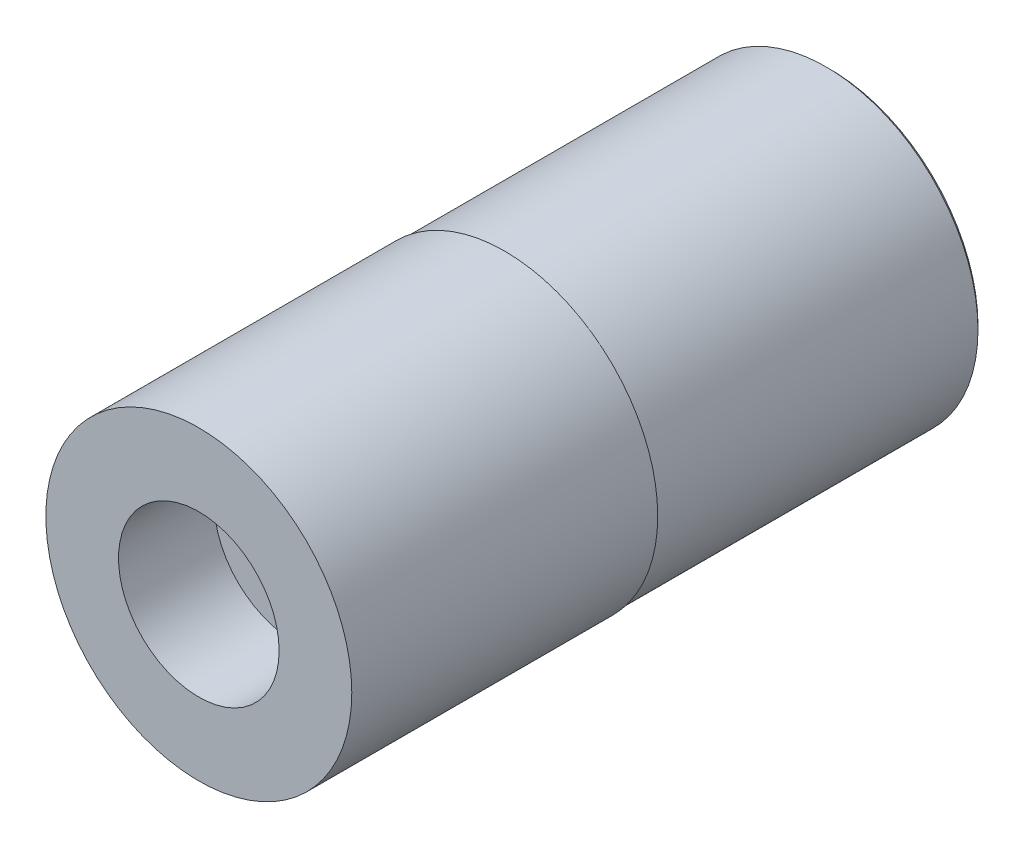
from build123d import *

# Parameters (mm, degrees)
SKETCH4_W          = 17
SKETCH4_H          = 1
CUT_EXTRUDE2_DEPTH = 4


with BuildPart() as part:
    # Sketch1 → Revolve1 (revolve)
    with BuildSketch(Plane(origin=(0, 0, 0), x_dir=(0, 0, -1), z_dir=(1, 0, 0)), mode=Mode.PRIVATE) as revolve1_sk:
        Polygon((0, 8), (0, 4.2), (5, 4.2), (5, 1.75), (25, 1.75), (25, 4), (33, 4), (33, 7.75), (32.75, 8), align=None)
    revolve(revolve1_sk.sketch.rotate(Axis((0, 0, 3.797909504), (0, 0, -1)), 90), axis=Axis((0, 0, 3.797909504), (0, 0, -1)))

    # Sketch4 → Cut-Revolve1 (revolve, cut)
    with BuildSketch(Plane(origin=(0, 0, 0), x_dir=(0, 0, -1), z_dir=(1, 0, 0)), mode=Mode.PRIVATE) as cut_revolve1_sk:
        with Locations((24.5, 8.435)):
            Rectangle(SKETCH4_W, SKETCH4_H)
    revolve(cut_revolve1_sk.sketch.rotate(Axis((0, 0, 0), (0, 0, -1)), 90), axis=Axis((0, 0, 0), (0, 0, -1)), mode=Mode.SUBTRACT)

    # Sketch3 → Cut-Extrude2 (cut)
    with BuildSketch(Plane.XY.offset(-5)):
        Polygon((1.010362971, 1.75), (-1.010362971, 1.75), (-2.020725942, 0), (-1.010362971, -1.75), (1.010362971, -1.75), (2.020725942, 0), align=None)
    extrude(amount=-CUT_EXTRUDE2_DEPTH, mode=Mode.SUBTRACT)


solid = part.part
